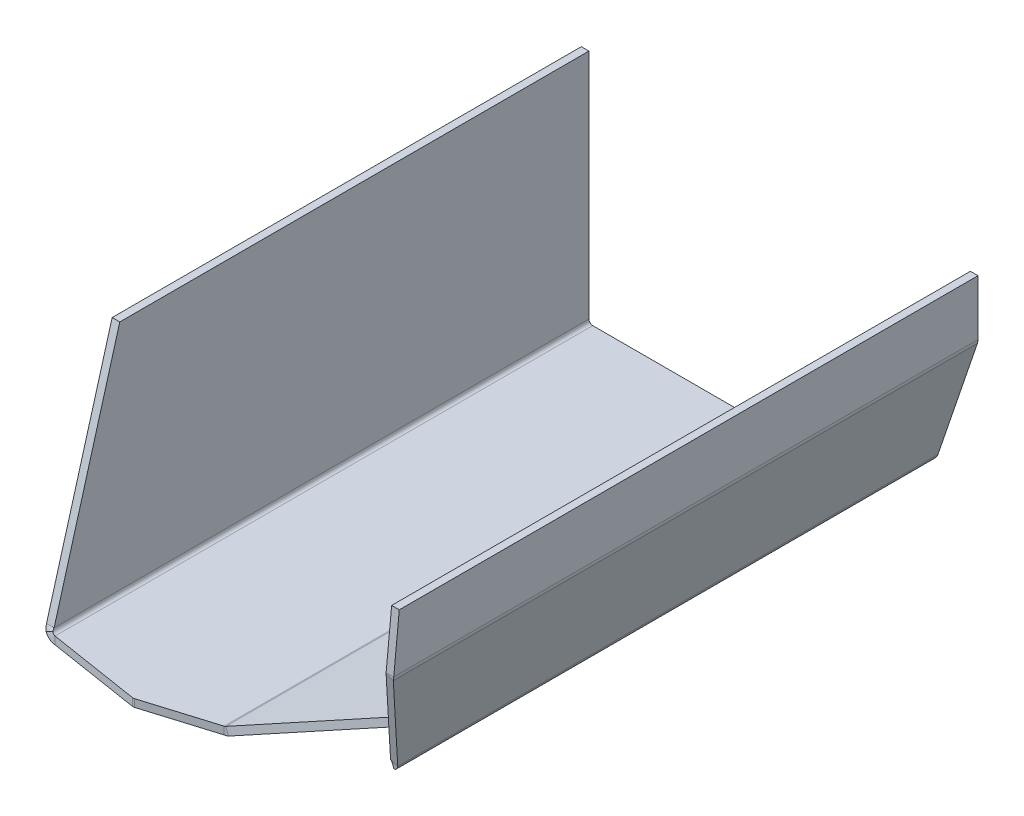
ISO-10303-21;
HEADER;
FILE_DESCRIPTION(('STEP AP214'),'2;1');
FILE_NAME('part.step','',(''),(''),'','','');
FILE_SCHEMA(('AUTOMOTIVE_DESIGN { 1 0 10303 214 1 1 1 1 }'));
ENDSEC;
DATA;
#1=APPLICATION_CONTEXT('core data for automotive mechanical design processes');
#2=APPLICATION_PROTOCOL_DEFINITION('international standard','automotive_design',2000,#1);
#3=PRODUCT_CONTEXT('',#1,'mechanical');
#4=PRODUCT('Part','Part','',(#3));
#5=PRODUCT_RELATED_PRODUCT_CATEGORY('part','',(#4));
#6=PRODUCT_DEFINITION_FORMATION('','',#4);
#7=PRODUCT_DEFINITION_CONTEXT('part definition',#1,'design');
#8=PRODUCT_DEFINITION('design','',#6,#7);
#9=PRODUCT_DEFINITION_SHAPE('','',#8);
#10=(LENGTH_UNIT() NAMED_UNIT(*) SI_UNIT(.MILLI.,.METRE.));
#11=(NAMED_UNIT(*) PLANE_ANGLE_UNIT() SI_UNIT($,.RADIAN.));
#12=(NAMED_UNIT(*) SI_UNIT($,.STERADIAN.) SOLID_ANGLE_UNIT());
#13=UNCERTAINTY_MEASURE_WITH_UNIT(LENGTH_MEASURE(1.E-05),#10,'distance_accuracy_value','');
#14=(GEOMETRIC_REPRESENTATION_CONTEXT(3) GLOBAL_UNCERTAINTY_ASSIGNED_CONTEXT((#13)) GLOBAL_UNIT_ASSIGNED_CONTEXT((#10,
#11,#12)) REPRESENTATION_CONTEXT('',''));
#15=CARTESIAN_POINT('',(0.,0.,0.));
#16=DIRECTION('',(0.,0.,1.));
#17=DIRECTION('',(1.,0.,0.));
#18=AXIS2_PLACEMENT_3D('',#15,#16,#17);
#19=CARTESIAN_POINT('',(102.081649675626,47.203392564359,264.));
#20=DIRECTION('',(-1.,0.,0.));
#21=DIRECTION('',(0.,0.,1.));
#22=AXIS2_PLACEMENT_3D('',#19,#20,#21);
#23=PLANE('',#22);
#24=DIRECTION('',(0.,-0.995076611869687,0.0991087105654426));
#25=VECTOR('',#24,1.);
#26=CARTESIAN_POINT('',(102.081649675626,36.2871828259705,154.398483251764));
#27=LINE('',#26,#25);
#28=CARTESIAN_POINT('',(102.081649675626,61.8874884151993,151.848716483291));
#29=VERTEX_POINT('',#28);
#30=CARTESIAN_POINT('',(102.081649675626,47.3689958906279,153.294744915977));
#31=VERTEX_POINT('',#30);
#32=EDGE_CURVE('E558',#29,#31,#27,.T.);
#33=ORIENTED_EDGE('',*,*,#32,.T.);
#34=DIRECTION('',(0.,0.,-1.));
#35=VECTOR('',#34,1.);
#36=CARTESIAN_POINT('',(102.081649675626,47.3689958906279,264.));
#37=LINE('',#36,#35);
#38=CARTESIAN_POINT('',(102.081649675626,47.3689958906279,0.));
#39=VERTEX_POINT('',#38);
#40=EDGE_CURVE('E58',#31,#39,#37,.T.);
#41=ORIENTED_EDGE('',*,*,#40,.T.);
#42=DIRECTION('',(0.,1.,0.));
#43=VECTOR('',#42,1.);
#44=CARTESIAN_POINT('',(102.081649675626,47.203392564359,0.));
#45=LINE('',#44,#43);
#46=CARTESIAN_POINT('',(102.081649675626,61.8874884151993,0.));
#47=VERTEX_POINT('',#46);
#48=EDGE_CURVE('E400',#39,#47,#45,.T.);
#49=ORIENTED_EDGE('',*,*,#48,.T.);
#50=DIRECTION('',(0.,0.,-1.));
#51=VECTOR('',#50,1.);
#52=CARTESIAN_POINT('',(102.081649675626,61.8874884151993,264.));
#53=LINE('',#52,#51);
#54=EDGE_CURVE('E272',#29,#47,#53,.T.);
#55=ORIENTED_EDGE('',*,*,#54,.F.);
#56=EDGE_LOOP('',(#33,#41,#49,#55));
#57=FACE_BOUND('',#56,.T.);
#58=ADVANCED_FACE('F35',(#57),#23,.F.);
#59=CARTESIAN_POINT('',(100.081649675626,61.8874884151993,264.));
#60=DIRECTION('',(0.,1.,0.));
#61=DIRECTION('',(0.,0.,1.));
#62=AXIS2_PLACEMENT_3D('',#59,#60,#61);
#63=PLANE('',#62);
#64=DIRECTION('',(0.,0.,-1.));
#65=VECTOR('',#64,1.);
#66=CARTESIAN_POINT('',(100.081649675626,61.8874884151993,264.));
#67=LINE('',#66,#65);
#68=CARTESIAN_POINT('',(100.081649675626,61.8874884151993,151.848716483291));
#69=VERTEX_POINT('',#68);
#70=CARTESIAN_POINT('',(100.081649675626,61.8874884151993,0.));
#71=VERTEX_POINT('',#70);
#72=EDGE_CURVE('E270',#69,#71,#67,.T.);
#73=ORIENTED_EDGE('',*,*,#72,.F.);
#74=DIRECTION('',(-1.,0.,0.));
#75=VECTOR('',#74,1.);
#76=CARTESIAN_POINT('',(100.081649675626,61.8874884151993,151.848716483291));
#77=LINE('',#76,#75);
#78=EDGE_CURVE('E560',#69,#29,#77,.F.);
#79=ORIENTED_EDGE('',*,*,#78,.T.);
#80=ORIENTED_EDGE('',*,*,#54,.T.);
#81=DIRECTION('',(1.,0.,0.));
#82=VECTOR('',#81,1.);
#83=CARTESIAN_POINT('',(100.081649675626,61.8874884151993,0.));
#84=LINE('',#83,#82);
#85=EDGE_CURVE('E397',#71,#47,#84,.T.);
#86=ORIENTED_EDGE('',*,*,#85,.F.);
#87=EDGE_LOOP('',(#73,#79,#80,#86));
#88=FACE_BOUND('',#87,.T.);
#89=ADVANCED_FACE('F486',(#88),#63,.T.);
#90=CARTESIAN_POINT('',(100.081649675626,47.203392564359,264.));
#91=DIRECTION('',(-1.,0.,0.));
#92=DIRECTION('',(0.,0.,1.));
#93=AXIS2_PLACEMENT_3D('',#90,#91,#92);
#94=PLANE('',#93);
#95=DIRECTION('',(0.,0.,-1.));
#96=VECTOR('',#95,1.);
#97=CARTESIAN_POINT('',(100.081649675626,47.3689958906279,264.));
#98=LINE('',#97,#96);
#99=CARTESIAN_POINT('',(100.081649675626,47.3689958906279,153.294744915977));
#100=VERTEX_POINT('',#99);
#101=CARTESIAN_POINT('',(100.081649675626,47.3689958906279,0.));
#102=VERTEX_POINT('',#101);
#103=EDGE_CURVE('E268',#100,#102,#98,.T.);
#104=ORIENTED_EDGE('',*,*,#103,.F.);
#105=DIRECTION('',(0.,-0.995076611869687,0.0991087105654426));
#106=VECTOR('',#105,1.);
#107=CARTESIAN_POINT('',(100.081649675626,36.2871828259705,154.398483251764));
#108=LINE('',#107,#106);
#109=EDGE_CURVE('E556',#69,#100,#108,.T.);
#110=ORIENTED_EDGE('',*,*,#109,.F.);
#111=ORIENTED_EDGE('',*,*,#72,.T.);
#112=DIRECTION('',(0.,1.,0.));
#113=VECTOR('',#112,1.);
#114=CARTESIAN_POINT('',(100.081649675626,47.203392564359,0.));
#115=LINE('',#114,#113);
#116=EDGE_CURVE('E394',#102,#71,#115,.T.);
#117=ORIENTED_EDGE('',*,*,#116,.F.);
#118=EDGE_LOOP('',(#104,#110,#111,#117));
#119=FACE_BOUND('',#118,.T.);
#120=ADVANCED_FACE('F482',(#119),#94,.T.);
#121=CARTESIAN_POINT('',(99.0816496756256,47.3689958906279,264.));
#122=DIRECTION('',(0.,0.,-1.));
#123=DIRECTION('',(-1.,0.,0.));
#124=AXIS2_PLACEMENT_3D('',#121,#122,#123);
#125=CYLINDRICAL_SURFACE('',#124,1.);
#126=DIRECTION('',(0.,0.,-1.));
#127=VECTOR('',#126,1.);
#128=CARTESIAN_POINT('',(100.028264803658,47.0466299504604,264.));
#129=LINE('',#128,#127);
#130=CARTESIAN_POINT('',(100.028264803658,47.0466299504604,153.251838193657));
#131=VERTEX_POINT('',#130);
#132=CARTESIAN_POINT('',(100.028264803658,47.0466299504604,0.));
#133=VERTEX_POINT('',#132);
#134=EDGE_CURVE('E266',#131,#133,#129,.T.);
#135=ORIENTED_EDGE('',*,*,#134,.F.);
#136=CARTESIAN_POINT('',(99.0816496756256,47.3689958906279,151.889588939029));
#137=DIRECTION('',(0.813387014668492,-0.0576538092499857,-0.578858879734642));
#138=DIRECTION('',(-0.577410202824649,0.0409275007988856,-0.815427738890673));
#139=AXIS2_PLACEMENT_3D('',#136,#137,#138);
#140=ELLIPSE('',#139,1.72753677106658,1.);
#141=EDGE_CURVE('E551',#100,#131,#140,.T.);
#142=ORIENTED_EDGE('',*,*,#141,.F.);
#143=ORIENTED_EDGE('',*,*,#103,.T.);
#144=CARTESIAN_POINT('',(99.0816496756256,47.3689958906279,0.));
#145=DIRECTION('',(0.,0.,-1.));
#146=DIRECTION('',(-1.,0.,0.));
#147=AXIS2_PLACEMENT_3D('',#144,#145,#146);
#148=CIRCLE('',#147,1.);
#149=EDGE_CURVE('E389',#133,#102,#148,.F.);
#150=ORIENTED_EDGE('',*,*,#149,.F.);
#151=EDGE_LOOP('',(#135,#142,#143,#150));
#152=FACE_BOUND('',#151,.T.);
#153=ADVANCED_FACE('F478',(#152),#125,.F.);
#154=CARTESIAN_POINT('',(89.5254696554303,16.2055777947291,264.));
#155=DIRECTION('',(-0.946615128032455,0.322365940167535,0.));
#156=DIRECTION('',(-0.322365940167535,-0.946615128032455,0.));
#157=AXIS2_PLACEMENT_3D('',#154,#155,#156);
#158=PLANE('',#157);
#159=DIRECTION('',(0.,0.,-1.));
#160=VECTOR('',#159,1.);
#161=CARTESIAN_POINT('',(89.6815545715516,16.6639151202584,264.));
#162=LINE('',#161,#160);
#163=CARTESIAN_POINT('',(89.6815545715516,16.6639151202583,141.739186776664));
#164=VERTEX_POINT('',#163);
#165=CARTESIAN_POINT('',(89.6815545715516,16.6639151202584,0.));
#166=VERTEX_POINT('',#165);
#167=EDGE_CURVE('E264',#164,#166,#162,.T.);
#168=ORIENTED_EDGE('',*,*,#167,.F.);
#169=DIRECTION('',(-0.30343629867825,-0.891028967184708,-0.337629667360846));
#170=VECTOR('',#169,1.);
#171=CARTESIAN_POINT('',(102.068772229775,53.0385011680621,155.522284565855));
#172=LINE('',#171,#170);
#173=EDGE_CURVE('E566',#131,#164,#172,.T.);
#174=ORIENTED_EDGE('',*,*,#173,.F.);
#175=ORIENTED_EDGE('',*,*,#134,.T.);
#176=DIRECTION('',(0.322365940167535,0.946615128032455,0.));
#177=VECTOR('',#176,1.);
#178=CARTESIAN_POINT('',(89.5254696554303,16.2055777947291,0.));
#179=LINE('',#178,#177);
#180=EDGE_CURVE('E385',#166,#133,#179,.T.);
#181=ORIENTED_EDGE('',*,*,#180,.F.);
#182=EDGE_LOOP('',(#168,#174,#175,#181));
#183=FACE_BOUND('',#182,.T.);
#184=ADVANCED_FACE('F475',(#183),#158,.T.);
#185=CARTESIAN_POINT('',(88.7349394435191,16.9862810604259,264.));
#186=DIRECTION('',(0.,0.,-1.));
#187=DIRECTION('',(-1.,0.,0.));
#188=AXIS2_PLACEMENT_3D('',#185,#186,#187);
#189=CYLINDRICAL_SURFACE('',#188,1.);
#190=DIRECTION('',(0.,0.,-1.));
#191=VECTOR('',#190,1.);
#192=CARTESIAN_POINT('',(89.0691205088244,16.0437721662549,264.));
#193=LINE('',#192,#191);
#194=CARTESIAN_POINT('',(89.0691205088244,16.0437721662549,140.940387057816));
#195=VERTEX_POINT('',#194);
#196=CARTESIAN_POINT('',(89.0691205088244,16.0437721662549,0.));
#197=VERTEX_POINT('',#196);
#198=EDGE_CURVE('E262',#195,#197,#193,.T.);
#199=ORIENTED_EDGE('',*,*,#198,.F.);
#200=CARTESIAN_POINT('',(88.7349394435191,16.9862810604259,140.376937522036));
#201=DIRECTION('',(0.813387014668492,-0.0576538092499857,-0.578858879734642));
#202=DIRECTION('',(-0.577410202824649,0.0409275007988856,-0.815427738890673));
#203=AXIS2_PLACEMENT_3D('',#200,#201,#202);
#204=ELLIPSE('',#203,1.72753677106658,1.);
#205=EDGE_CURVE('E546',#164,#195,#204,.T.);
#206=ORIENTED_EDGE('',*,*,#205,.F.);
#207=ORIENTED_EDGE('',*,*,#167,.T.);
#208=CARTESIAN_POINT('',(88.7349394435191,16.9862810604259,0.));
#209=DIRECTION('',(0.,0.,-1.));
#210=DIRECTION('',(-1.,0.,0.));
#211=AXIS2_PLACEMENT_3D('',#208,#209,#210);
#212=CIRCLE('',#211,1.);
#213=EDGE_CURVE('E379',#197,#166,#212,.F.);
#214=ORIENTED_EDGE('',*,*,#213,.F.);
#215=EDGE_LOOP('',(#199,#206,#207,#214));
#216=FACE_BOUND('',#215,.T.);
#217=ADVANCED_FACE('F382',(#216),#189,.F.);
#218=CARTESIAN_POINT('',(43.820003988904,0.,264.));
#219=DIRECTION('',(-0.334181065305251,0.942508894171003,0.));
#220=DIRECTION('',(-0.942508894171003,-0.334181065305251,0.));
#221=AXIS2_PLACEMENT_3D('',#218,#219,#220);
#222=PLANE('',#221);
#223=CARTESIAN_POINT('',(76.3194549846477,11.5231816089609,128.657975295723));
#224=DIRECTION('',(-0.334181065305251,0.942508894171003,0.));
#225=DIRECTION('',(-0.507415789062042,-0.179912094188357,0.842710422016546));
#226=AXIS2_PLACEMENT_3D('',#223,#224,#225);
#227=ELLIPSE('',#226,3.19503602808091,2.99999999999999);
#228=CARTESIAN_POINT('',(78.6145448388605,12.336941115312,126.619274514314));
#229=VERTEX_POINT('',#228);
#230=CARTESIAN_POINT('',(75.3963302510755,11.1958734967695,125.745914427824));
#231=VERTEX_POINT('',#230);
#232=EDGE_CURVE('E577',#229,#231,#227,.T.);
#233=ORIENTED_EDGE('',*,*,#232,.F.);
#234=DIRECTION('',(-0.577140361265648,-0.204634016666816,-0.790590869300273));
#235=VECTOR('',#234,1.);
#236=CARTESIAN_POINT('',(128.25211077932,29.9367057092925,194.614876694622));
#237=LINE('',#236,#235);
#238=EDGE_CURVE('E581',#195,#229,#237,.T.);
#239=ORIENTED_EDGE('',*,*,#238,.F.);
#240=ORIENTED_EDGE('',*,*,#198,.T.);
#241=DIRECTION('',(0.942508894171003,0.334181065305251,0.));
#242=VECTOR('',#241,1.);
#243=CARTESIAN_POINT('',(43.820003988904,0.,0.));
#244=LINE('',#243,#242);
#245=CARTESIAN_POINT('',(43.982149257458,0.0574911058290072,0.));
#246=VERTEX_POINT('',#245);
#247=EDGE_CURVE('E373',#246,#197,#244,.T.);
#248=ORIENTED_EDGE('',*,*,#247,.F.);
#249=DIRECTION('',(0.,0.,-1.));
#250=VECTOR('',#249,1.);
#251=CARTESIAN_POINT('',(43.982149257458,0.0574911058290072,264.));
#252=LINE('',#251,#250);
#253=CARTESIAN_POINT('',(43.982149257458,0.0574911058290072,139.252749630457));
#254=VERTEX_POINT('',#253);
#255=EDGE_CURVE('E260',#254,#246,#252,.T.);
#256=ORIENTED_EDGE('',*,*,#255,.F.);
#257=DIRECTION('',(-0.873510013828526,-0.309716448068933,0.375574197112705));
#258=VECTOR('',#257,1.);
#259=CARTESIAN_POINT('',(2.91731680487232,-14.5026786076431,156.908977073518));
#260=LINE('',#259,#258);
#261=EDGE_CURVE('E587',#231,#254,#260,.T.);
#262=ORIENTED_EDGE('',*,*,#261,.F.);
#263=EDGE_LOOP('',(#233,#239,#240,#248,#256,#262));
#264=FACE_BOUND('',#263,.T.);
#265=ADVANCED_FACE('F468',(#264),#222,.T.);
#266=CARTESIAN_POINT('',(43.6479681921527,1.00000000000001,264.));
#267=DIRECTION('',(0.,0.,-1.));
#268=DIRECTION('',(-1.,0.,0.));
#269=AXIS2_PLACEMENT_3D('',#266,#267,#268);
#270=CYLINDRICAL_SURFACE('',#269,1.);
#271=DIRECTION('',(0.,0.,-1.));
#272=VECTOR('',#271,1.);
#273=CARTESIAN_POINT('',(43.6479681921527,0.,264.));
#274=LINE('',#273,#272);
#275=CARTESIAN_POINT('',(43.6479681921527,0.,139.375017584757));
#276=VERTEX_POINT('',#275);
#277=CARTESIAN_POINT('',(43.6479681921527,0.,0.));
#278=VERTEX_POINT('',#277);
#279=EDGE_CURVE('E258',#276,#278,#274,.T.);
#280=ORIENTED_EDGE('',*,*,#279,.F.);
#281=CARTESIAN_POINT('',(43.6479681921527,1.00000000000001,139.023916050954));
#282=DIRECTION('',(-0.276948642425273,-0.318318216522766,-0.906627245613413));
#283=DIRECTION('',(0.595093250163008,0.683986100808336,-0.421932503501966));
#284=AXIS2_PLACEMENT_3D('',#281,#282,#283);
#285=ELLIPSE('',#284,1.10298913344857,1.);
#286=EDGE_CURVE('E542',#254,#276,#285,.T.);
#287=ORIENTED_EDGE('',*,*,#286,.F.);
#288=ORIENTED_EDGE('',*,*,#255,.T.);
#289=CARTESIAN_POINT('',(43.6479681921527,1.00000000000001,0.));
#290=DIRECTION('',(0.,0.,-1.));
#291=DIRECTION('',(-1.,0.,0.));
#292=AXIS2_PLACEMENT_3D('',#289,#290,#291);
#293=CIRCLE('',#292,1.);
#294=EDGE_CURVE('E307',#278,#246,#293,.F.);
#295=ORIENTED_EDGE('',*,*,#294,.F.);
#296=EDGE_LOOP('',(#280,#287,#288,#295));
#297=FACE_BOUND('',#296,.T.);
#298=ADVANCED_FACE('F465',(#297),#270,.F.);
#299=CARTESIAN_POINT('',(0.,0.,264.));
#300=DIRECTION('',(0.,1.,0.));
#301=DIRECTION('',(0.,0.,1.));
#302=AXIS2_PLACEMENT_3D('',#299,#300,#301);
#303=PLANE('',#302);
#304=DIRECTION('',(0.,0.,-1.));
#305=VECTOR('',#304,1.);
#306=CARTESIAN_POINT('',(1.,0.,264.));
#307=LINE('',#306,#305);
#308=CARTESIAN_POINT('',(1.,0.,141.083825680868));
#309=VERTEX_POINT('',#308);
#310=CARTESIAN_POINT('',(1.,0.,0.));
#311=VERTEX_POINT('',#310);
#312=EDGE_CURVE('E256',#309,#311,#307,.T.);
#313=ORIENTED_EDGE('',*,*,#312,.F.);
#314=DIRECTION('',(-0.987665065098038,0.,-0.156581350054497));
#315=VECTOR('',#314,1.);
#316=CARTESIAN_POINT('',(19.0334953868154,0.,143.94279999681));
#317=LINE('',#316,#315);
#318=CARTESIAN_POINT('',(25.1710812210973,0.,144.915833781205));
#319=VERTEX_POINT('',#318);
#320=EDGE_CURVE('E224',#319,#309,#317,.T.);
#321=ORIENTED_EDGE('',*,*,#320,.F.);
#322=CARTESIAN_POINT('',(25.282325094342,0.,143.88220611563));
#323=DIRECTION('',(0.,1.,0.));
#324=DIRECTION('',(0.432856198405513,0.,0.901462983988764));
#325=AXIS2_PLACEMENT_3D('',#322,#323,#324);
#326=ELLIPSE('',#325,1.05610997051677,0.999999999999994);
#327=CARTESIAN_POINT('',(25.6060740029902,0.,144.886299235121));
#328=VERTEX_POINT('',#327);
#329=EDGE_CURVE('E637',#328,#319,#326,.F.);
#330=ORIENTED_EDGE('',*,*,#329,.F.);
#331=DIRECTION('',(-0.956374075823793,0.,0.292144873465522));
#332=VECTOR('',#331,1.);
#333=CARTESIAN_POINT('',(-31.0948989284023,0.,162.206821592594));
#334=LINE('',#333,#332);
#335=EDGE_CURVE('E624',#276,#328,#334,.T.);
#336=ORIENTED_EDGE('',*,*,#335,.F.);
#337=ORIENTED_EDGE('',*,*,#279,.T.);
#338=DIRECTION('',(1.,0.,0.));
#339=VECTOR('',#338,1.);
#340=CARTESIAN_POINT('',(0.,0.,0.));
#341=LINE('',#340,#339);
#342=EDGE_CURVE('E296',#311,#278,#341,.T.);
#343=ORIENTED_EDGE('',*,*,#342,.F.);
#344=EDGE_LOOP('',(#313,#321,#330,#336,#337,#343));
#345=FACE_BOUND('',#344,.T.);
#346=ADVANCED_FACE('F302',(#345),#303,.T.);
#347=CARTESIAN_POINT('',(1.,1.,264.));
#348=DIRECTION('',(0.,0.,-1.));
#349=DIRECTION('',(-1.,0.,0.));
#350=AXIS2_PLACEMENT_3D('',#347,#348,#349);
#351=CYLINDRICAL_SURFACE('',#350,1.);
#352=DIRECTION('',(0.,0.,-1.));
#353=VECTOR('',#352,1.);
#354=CARTESIAN_POINT('',(0.,1.,264.));
#355=LINE('',#354,#353);
#356=CARTESIAN_POINT('',(0.,1.,140.325333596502));
#357=VERTEX_POINT('',#356);
#358=CARTESIAN_POINT('',(0.,1.,0.));
#359=VERTEX_POINT('',#358);
#360=EDGE_CURVE('E254',#357,#359,#355,.T.);
#361=ORIENTED_EDGE('',*,*,#360,.F.);
#362=CARTESIAN_POINT('',(1.,1.,140.800944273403));
#363=DIRECTION('',(0.34090648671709,-0.608288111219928,-0.716776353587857));
#364=DIRECTION('',(-0.3504268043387,0.625275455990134,-0.697303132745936));
#365=AXIS2_PLACEMENT_3D('',#362,#363,#364);
#366=ELLIPSE('',#365,1.39513530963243,1.);
#367=CARTESIAN_POINT('',(0.127656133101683,0.511107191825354,140.800944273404));
#368=VERTEX_POINT('',#367);
#369=EDGE_CURVE('E520',#368,#357,#366,.T.);
#370=ORIENTED_EDGE('',*,*,#369,.F.);
#371=CARTESIAN_POINT('',(1.,1.,140.800944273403));
#372=DIRECTION('',(0.150805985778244,-0.269086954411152,-0.951235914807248));
#373=DIRECTION('',(-0.465052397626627,0.829804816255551,-0.308464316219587));
#374=AXIS2_PLACEMENT_3D('',#371,#372,#373);
#375=ELLIPSE('',#374,1.05126392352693,1.);
#376=EDGE_CURVE('E215',#309,#368,#375,.T.);
#377=ORIENTED_EDGE('',*,*,#376,.F.);
#378=ORIENTED_EDGE('',*,*,#312,.T.);
#379=CARTESIAN_POINT('',(1.,1.,0.));
#380=DIRECTION('',(0.,0.,-1.));
#381=DIRECTION('',(-1.,0.,0.));
#382=AXIS2_PLACEMENT_3D('',#379,#380,#381);
#383=CIRCLE('',#382,1.);
#384=EDGE_CURVE('E306',#359,#311,#383,.F.);
#385=ORIENTED_EDGE('',*,*,#384,.F.);
#386=EDGE_LOOP('',(#361,#370,#377,#378,#385));
#387=FACE_BOUND('',#386,.T.);
#388=ADVANCED_FACE('F459',(#387),#351,.F.);
#389=CARTESIAN_POINT('',(0.,61.8874884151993,264.));
#390=DIRECTION('',(1.,0.,0.));
#391=DIRECTION('',(0.,0.,-1.));
#392=AXIS2_PLACEMENT_3D('',#389,#390,#391);
#393=PLANE('',#392);
#394=DIRECTION('',(0.,0.,-1.));
#395=VECTOR('',#394,1.);
#396=CARTESIAN_POINT('',(0.,61.8874884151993,264.));
#397=LINE('',#396,#395);
#398=CARTESIAN_POINT('',(0.,61.8874884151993,123.101395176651));
#399=VERTEX_POINT('',#398);
#400=CARTESIAN_POINT('',(0.,61.8874884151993,0.));
#401=VERTEX_POINT('',#400);
#402=EDGE_CURVE('E252',#399,#401,#397,.T.);
#403=ORIENTED_EDGE('',*,*,#402,.F.);
#404=DIRECTION('',(0.,0.962240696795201,-0.272200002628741));
#405=VECTOR('',#404,1.);
#406=CARTESIAN_POINT('',(0.,24.9830552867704,133.540973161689));
#407=LINE('',#406,#405);
#408=EDGE_CURVE('E518',#357,#399,#407,.T.);
#409=ORIENTED_EDGE('',*,*,#408,.F.);
#410=ORIENTED_EDGE('',*,*,#360,.T.);
#411=DIRECTION('',(0.,-1.,0.));
#412=VECTOR('',#411,1.);
#413=CARTESIAN_POINT('',(0.,61.8874884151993,0.));
#414=LINE('',#413,#412);
#415=EDGE_CURVE('E314',#401,#359,#414,.T.);
#416=ORIENTED_EDGE('',*,*,#415,.F.);
#417=EDGE_LOOP('',(#403,#409,#410,#416));
#418=FACE_BOUND('',#417,.T.);
#419=ADVANCED_FACE('F455',(#418),#393,.T.);
#420=CARTESIAN_POINT('',(-2.,61.8874884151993,264.));
#421=DIRECTION('',(0.,1.,0.));
#422=DIRECTION('',(0.,0.,1.));
#423=AXIS2_PLACEMENT_3D('',#420,#421,#422);
#424=PLANE('',#423);
#425=DIRECTION('',(0.,0.,-1.));
#426=VECTOR('',#425,1.);
#427=CARTESIAN_POINT('',(-2.,61.8874884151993,264.));
#428=LINE('',#427,#426);
#429=CARTESIAN_POINT('',(-2.,61.8874884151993,123.101395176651));
#430=VERTEX_POINT('',#429);
#431=CARTESIAN_POINT('',(-2.,61.8874884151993,0.));
#432=VERTEX_POINT('',#431);
#433=EDGE_CURVE('E245',#430,#432,#428,.T.);
#434=ORIENTED_EDGE('',*,*,#433,.F.);
#435=DIRECTION('',(-1.,0.,0.));
#436=VECTOR('',#435,1.);
#437=CARTESIAN_POINT('',(-2.,61.8874884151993,123.101395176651));
#438=LINE('',#437,#436);
#439=EDGE_CURVE('E539',#430,#399,#438,.F.);
#440=ORIENTED_EDGE('',*,*,#439,.T.);
#441=ORIENTED_EDGE('',*,*,#402,.T.);
#442=DIRECTION('',(1.,0.,0.));
#443=VECTOR('',#442,1.);
#444=CARTESIAN_POINT('',(-2.,61.8874884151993,0.));
#445=LINE('',#444,#443);
#446=EDGE_CURVE('E316',#432,#401,#445,.T.);
#447=ORIENTED_EDGE('',*,*,#446,.F.);
#448=EDGE_LOOP('',(#434,#440,#441,#447));
#449=FACE_BOUND('',#448,.T.);
#450=ADVANCED_FACE('F451',(#449),#424,.T.);
#451=CARTESIAN_POINT('',(-2.,61.8874884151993,264.));
#452=DIRECTION('',(1.,0.,0.));
#453=DIRECTION('',(0.,0.,-1.));
#454=AXIS2_PLACEMENT_3D('',#451,#452,#453);
#455=PLANE('',#454);
#456=DIRECTION('',(0.,0.962240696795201,-0.272200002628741));
#457=VECTOR('',#456,1.);
#458=CARTESIAN_POINT('',(-2.,24.9830552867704,133.540973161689));
#459=LINE('',#458,#457);
#460=CARTESIAN_POINT('',(-2.,1.,140.325333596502));
#461=VERTEX_POINT('',#460);
#462=EDGE_CURVE('E523',#461,#430,#459,.T.);
#463=ORIENTED_EDGE('',*,*,#462,.T.);
#464=ORIENTED_EDGE('',*,*,#433,.T.);
#465=DIRECTION('',(0.,1.,0.));
#466=VECTOR('',#465,1.);
#467=CARTESIAN_POINT('',(-2.,61.8874884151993,0.));
#468=LINE('',#467,#466);
#469=CARTESIAN_POINT('',(-2.,1.,0.));
#470=VERTEX_POINT('',#469);
#471=EDGE_CURVE('E322',#432,#470,#468,.F.);
#472=ORIENTED_EDGE('',*,*,#471,.T.);
#473=DIRECTION('',(0.,0.,-1.));
#474=VECTOR('',#473,1.);
#475=CARTESIAN_POINT('',(-2.,1.,264.));
#476=LINE('',#475,#474);
#477=EDGE_CURVE('E242',#461,#470,#476,.T.);
#478=ORIENTED_EDGE('',*,*,#477,.F.);
#479=EDGE_LOOP('',(#463,#464,#472,#478));
#480=FACE_BOUND('',#479,.T.);
#481=ADVANCED_FACE('F448',(#480),#455,.F.);
#482=CARTESIAN_POINT('',(1.,1.,264.));
#483=DIRECTION('',(0.,0.,-1.));
#484=DIRECTION('',(-1.,0.,0.));
#485=AXIS2_PLACEMENT_3D('',#482,#483,#484);
#486=CYLINDRICAL_SURFACE('',#485,3.);
#487=CARTESIAN_POINT('',(1.,1.,140.800944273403));
#488=DIRECTION('',(0.150805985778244,-0.269086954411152,-0.951235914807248));
#489=DIRECTION('',(-0.465052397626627,0.829804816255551,-0.308464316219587));
#490=AXIS2_PLACEMENT_3D('',#487,#488,#489);
#491=ELLIPSE('',#490,3.1537917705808,3.);
#492=CARTESIAN_POINT('',(-1.61703160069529,-0.466678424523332,140.800944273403));
#493=VERTEX_POINT('',#492);
#494=EDGE_CURVE('E524',#493,#461,#491,.T.);
#495=ORIENTED_EDGE('',*,*,#494,.T.);
#496=ORIENTED_EDGE('',*,*,#477,.T.);
#497=CARTESIAN_POINT('',(1.,1.,0.));
#498=DIRECTION('',(0.,0.,1.));
#499=DIRECTION('',(1.,0.,0.));
#500=AXIS2_PLACEMENT_3D('',#497,#498,#499);
#501=CIRCLE('',#500,3.);
#502=CARTESIAN_POINT('',(1.,-2.,0.));
#503=VERTEX_POINT('',#502);
#504=EDGE_CURVE('E240',#470,#503,#501,.T.);
#505=ORIENTED_EDGE('',*,*,#504,.T.);
#506=DIRECTION('',(0.,0.,-1.));
#507=VECTOR('',#506,1.);
#508=CARTESIAN_POINT('',(1.,-2.,264.));
#509=LINE('',#508,#507);
#510=CARTESIAN_POINT('',(1.,-2.,141.083825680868));
#511=VERTEX_POINT('',#510);
#512=EDGE_CURVE('E232',#511,#503,#509,.T.);
#513=ORIENTED_EDGE('',*,*,#512,.F.);
#514=CARTESIAN_POINT('',(1.,1.,140.800944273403));
#515=DIRECTION('',(0.0525395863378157,-0.0937477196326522,-0.994208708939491));
#516=DIRECTION('',(-0.486061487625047,0.867291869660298,-0.107466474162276));
#517=AXIS2_PLACEMENT_3D('',#514,#515,#516);
#518=ELLIPSE('',#517,3.01747507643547,3.);
#519=EDGE_CURVE('E204',#511,#493,#518,.T.);
#520=ORIENTED_EDGE('',*,*,#519,.T.);
#521=EDGE_LOOP('',(#495,#496,#505,#513,#520));
#522=FACE_BOUND('',#521,.T.);
#523=ADVANCED_FACE('F238',(#522),#486,.T.);
#524=CARTESIAN_POINT('',(0.,-2.,264.));
#525=DIRECTION('',(0.,1.,0.));
#526=DIRECTION('',(0.,0.,1.));
#527=AXIS2_PLACEMENT_3D('',#524,#525,#526);
#528=PLANE('',#527);
#529=DIRECTION('',(-0.987665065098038,0.,-0.156581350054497));
#530=VECTOR('',#529,1.);
#531=CARTESIAN_POINT('',(19.0334953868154,-2.,143.94279999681));
#532=LINE('',#531,#530);
#533=CARTESIAN_POINT('',(25.1710812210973,-2.,144.915833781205));
#534=VERTEX_POINT('',#533);
#535=EDGE_CURVE('E221',#534,#511,#532,.T.);
#536=ORIENTED_EDGE('',*,*,#535,.T.);
#537=ORIENTED_EDGE('',*,*,#512,.T.);
#538=DIRECTION('',(1.,0.,0.));
#539=VECTOR('',#538,1.);
#540=CARTESIAN_POINT('',(0.,-2.,0.));
#541=LINE('',#540,#539);
#542=CARTESIAN_POINT('',(43.6479681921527,-1.99999999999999,0.));
#543=VERTEX_POINT('',#542);
#544=EDGE_CURVE('E297',#503,#543,#541,.T.);
#545=ORIENTED_EDGE('',*,*,#544,.T.);
#546=DIRECTION('',(0.,0.,-1.));
#547=VECTOR('',#546,1.);
#548=CARTESIAN_POINT('',(43.6479681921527,-1.99999999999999,264.));
#549=LINE('',#548,#547);
#550=CARTESIAN_POINT('',(43.6479681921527,-2.,139.375017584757));
#551=VERTEX_POINT('',#550);
#552=EDGE_CURVE('E243',#551,#543,#549,.T.);
#553=ORIENTED_EDGE('',*,*,#552,.F.);
#554=DIRECTION('',(-0.956374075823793,0.,0.292144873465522));
#555=VECTOR('',#554,1.);
#556=CARTESIAN_POINT('',(-31.0948989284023,-2.,162.206821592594));
#557=LINE('',#556,#555);
#558=CARTESIAN_POINT('',(25.6060740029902,-2.,144.886299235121));
#559=VERTEX_POINT('',#558);
#560=EDGE_CURVE('E635',#551,#559,#557,.T.);
#561=ORIENTED_EDGE('',*,*,#560,.T.);
#562=CARTESIAN_POINT('',(25.282325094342,-2.,143.88220611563));
#563=DIRECTION('',(0.,1.,0.));
#564=DIRECTION('',(0.432856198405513,0.,0.901462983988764));
#565=AXIS2_PLACEMENT_3D('',#562,#563,#564);
#566=ELLIPSE('',#565,1.05610997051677,0.999999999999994);
#567=EDGE_CURVE('E235',#559,#534,#566,.F.);
#568=ORIENTED_EDGE('',*,*,#567,.T.);
#569=EDGE_LOOP('',(#536,#537,#545,#553,#561,#568));
#570=FACE_BOUND('',#569,.T.);
#571=ADVANCED_FACE('F230',(#570),#528,.F.);
#572=CARTESIAN_POINT('',(43.6479681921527,1.00000000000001,264.));
#573=DIRECTION('',(0.,0.,-1.));
#574=DIRECTION('',(-1.,0.,0.));
#575=AXIS2_PLACEMENT_3D('',#572,#573,#574);
#576=CYLINDRICAL_SURFACE('',#575,3.);
#577=CARTESIAN_POINT('',(43.6479681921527,1.00000000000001,139.023916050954));
#578=DIRECTION('',(-0.100620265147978,-0.115650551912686,-0.988180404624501));
#579=DIRECTION('',(0.648623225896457,0.745512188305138,-0.153295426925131));
#580=AXIS2_PLACEMENT_3D('',#577,#578,#579);
#581=ELLIPSE('',#580,3.03588290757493,3.);
#582=CARTESIAN_POINT('',(44.6505113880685,-1.827526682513,139.252749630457));
#583=VERTEX_POINT('',#582);
#584=EDGE_CURVE('E544',#583,#551,#581,.T.);
#585=ORIENTED_EDGE('',*,*,#584,.T.);
#586=ORIENTED_EDGE('',*,*,#552,.T.);
#587=CARTESIAN_POINT('',(43.6479681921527,1.00000000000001,0.));
#588=DIRECTION('',(0.,0.,1.));
#589=DIRECTION('',(1.,0.,0.));
#590=AXIS2_PLACEMENT_3D('',#587,#588,#589);
#591=CIRCLE('',#590,3.);
#592=CARTESIAN_POINT('',(44.6505113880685,-1.827526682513,0.));
#593=VERTEX_POINT('',#592);
#594=EDGE_CURVE('E327',#543,#593,#591,.T.);
#595=ORIENTED_EDGE('',*,*,#594,.T.);
#596=DIRECTION('',(0.,0.,-1.));
#597=VECTOR('',#596,1.);
#598=CARTESIAN_POINT('',(44.6505113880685,-1.827526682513,264.));
#599=LINE('',#598,#597);
#600=EDGE_CURVE('E247',#583,#593,#599,.T.);
#601=ORIENTED_EDGE('',*,*,#600,.F.);
#602=EDGE_LOOP('',(#585,#586,#595,#601));
#603=FACE_BOUND('',#602,.T.);
#604=ADVANCED_FACE('F369',(#603),#576,.T.);
#605=CARTESIAN_POINT('',(44.4883661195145,-1.88501778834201,264.));
#606=DIRECTION('',(-0.334181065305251,0.942508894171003,0.));
#607=DIRECTION('',(-0.942508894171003,-0.334181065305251,0.));
#608=AXIS2_PLACEMENT_3D('',#605,#606,#607);
#609=PLANE('',#608);
#610=DIRECTION('',(-0.577140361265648,-0.204634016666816,-0.790590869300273));
#611=VECTOR('',#610,1.);
#612=CARTESIAN_POINT('',(128.920472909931,28.0516879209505,194.614876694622));
#613=LINE('',#612,#611);
#614=CARTESIAN_POINT('',(89.7374826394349,14.1587543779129,140.940387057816));
#615=VERTEX_POINT('',#614);
#616=CARTESIAN_POINT('',(79.282906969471,10.45192332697,126.619274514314));
#617=VERTEX_POINT('',#616);
#618=EDGE_CURVE('E582',#615,#617,#613,.T.);
#619=ORIENTED_EDGE('',*,*,#618,.T.);
#620=CARTESIAN_POINT('',(76.9878171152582,9.63816382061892,128.657975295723));
#621=DIRECTION('',(-0.334181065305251,0.942508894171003,0.));
#622=DIRECTION('',(-0.507415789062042,-0.179912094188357,0.842710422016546));
#623=AXIS2_PLACEMENT_3D('',#620,#621,#622);
#624=ELLIPSE('',#623,3.19503602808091,2.99999999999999);
#625=CARTESIAN_POINT('',(76.0646923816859,9.31085570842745,125.745914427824));
#626=VERTEX_POINT('',#625);
#627=EDGE_CURVE('E579',#617,#626,#624,.T.);
#628=ORIENTED_EDGE('',*,*,#627,.T.);
#629=DIRECTION('',(-0.873510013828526,-0.309716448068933,0.375574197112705));
#630=VECTOR('',#629,1.);
#631=CARTESIAN_POINT('',(3.58567893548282,-16.3876963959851,156.908977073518));
#632=LINE('',#631,#630);
#633=EDGE_CURVE('E358',#626,#583,#632,.T.);
#634=ORIENTED_EDGE('',*,*,#633,.T.);
#635=ORIENTED_EDGE('',*,*,#600,.T.);
#636=DIRECTION('',(0.942508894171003,0.334181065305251,0.));
#637=VECTOR('',#636,1.);
#638=CARTESIAN_POINT('',(44.4883661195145,-1.88501778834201,0.));
#639=LINE('',#638,#637);
#640=CARTESIAN_POINT('',(89.7374826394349,14.1587543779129,0.));
#641=VERTEX_POINT('',#640);
#642=EDGE_CURVE('E330',#593,#641,#639,.T.);
#643=ORIENTED_EDGE('',*,*,#642,.T.);
#644=DIRECTION('',(0.,0.,-1.));
#645=VECTOR('',#644,1.);
#646=CARTESIAN_POINT('',(89.7374826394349,14.1587543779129,264.));
#647=LINE('',#646,#645);
#648=EDGE_CURVE('E347',#615,#641,#647,.T.);
#649=ORIENTED_EDGE('',*,*,#648,.F.);
#650=EDGE_LOOP('',(#619,#628,#634,#635,#643,#649));
#651=FACE_BOUND('',#650,.T.);
#652=ADVANCED_FACE('F353',(#651),#609,.F.);
#653=CARTESIAN_POINT('',(88.7349394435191,16.9862810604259,264.));
#654=DIRECTION('',(0.,0.,-1.));
#655=DIRECTION('',(-1.,0.,0.));
#656=AXIS2_PLACEMENT_3D('',#653,#654,#655);
#657=CYLINDRICAL_SURFACE('',#656,3.);
#658=CARTESIAN_POINT('',(88.7349394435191,16.9862810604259,140.376937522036));
#659=DIRECTION('',(0.423971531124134,-0.030051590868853,-0.905176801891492));
#660=DIRECTION('',(-0.902911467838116,0.0639994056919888,-0.42503524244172));
#661=AXIS2_PLACEMENT_3D('',#658,#659,#660);
#662=ELLIPSE('',#661,3.31426964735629,3.);
#663=CARTESIAN_POINT('',(91.5747848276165,16.0191832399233,141.739186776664));
#664=VERTEX_POINT('',#663);
#665=EDGE_CURVE('E548',#664,#615,#662,.T.);
#666=ORIENTED_EDGE('',*,*,#665,.T.);
#667=ORIENTED_EDGE('',*,*,#648,.T.);
#668=CARTESIAN_POINT('',(88.7349394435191,16.9862810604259,0.));
#669=DIRECTION('',(0.,0.,1.));
#670=DIRECTION('',(1.,0.,0.));
#671=AXIS2_PLACEMENT_3D('',#668,#669,#670);
#672=CIRCLE('',#671,3.);
#673=CARTESIAN_POINT('',(91.5747848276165,16.0191832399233,0.));
#674=VERTEX_POINT('',#673);
#675=EDGE_CURVE('E333',#641,#674,#672,.T.);
#676=ORIENTED_EDGE('',*,*,#675,.T.);
#677=DIRECTION('',(0.,0.,-1.));
#678=VECTOR('',#677,1.);
#679=CARTESIAN_POINT('',(91.5747848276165,16.0191832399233,264.));
#680=LINE('',#679,#678);
#681=EDGE_CURVE('E345',#664,#674,#680,.T.);
#682=ORIENTED_EDGE('',*,*,#681,.F.);
#683=EDGE_LOOP('',(#666,#667,#676,#682));
#684=FACE_BOUND('',#683,.T.);
#685=ADVANCED_FACE('F435',(#684),#657,.T.);
#686=CARTESIAN_POINT('',(91.4186999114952,15.5608459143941,264.));
#687=DIRECTION('',(-0.946615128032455,0.322365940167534,0.));
#688=DIRECTION('',(-0.322365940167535,-0.946615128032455,0.));
#689=AXIS2_PLACEMENT_3D('',#686,#687,#688);
#690=PLANE('',#689);
#691=DIRECTION('',(-0.30343629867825,-0.891028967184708,-0.337629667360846));
#692=VECTOR('',#691,1.);
#693=CARTESIAN_POINT('',(103.96200248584,52.393769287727,155.522284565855));
#694=LINE('',#693,#692);
#695=CARTESIAN_POINT('',(101.921495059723,46.4018980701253,153.251838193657));
#696=VERTEX_POINT('',#695);
#697=EDGE_CURVE('E569',#696,#664,#694,.T.);
#698=ORIENTED_EDGE('',*,*,#697,.T.);
#699=ORIENTED_EDGE('',*,*,#681,.T.);
#700=DIRECTION('',(0.322365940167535,0.946615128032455,0.));
#701=VECTOR('',#700,1.);
#702=CARTESIAN_POINT('',(91.4186999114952,15.5608459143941,0.));
#703=LINE('',#702,#701);
#704=CARTESIAN_POINT('',(101.921495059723,46.4018980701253,0.));
#705=VERTEX_POINT('',#704);
#706=EDGE_CURVE('E336',#674,#705,#703,.T.);
#707=ORIENTED_EDGE('',*,*,#706,.T.);
#708=DIRECTION('',(0.,0.,-1.));
#709=VECTOR('',#708,1.);
#710=CARTESIAN_POINT('',(101.921495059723,46.4018980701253,264.));
#711=LINE('',#710,#709);
#712=EDGE_CURVE('E343',#696,#705,#711,.T.);
#713=ORIENTED_EDGE('',*,*,#712,.F.);
#714=EDGE_LOOP('',(#698,#699,#707,#713));
#715=FACE_BOUND('',#714,.T.);
#716=ADVANCED_FACE('F431',(#715),#690,.F.);
#717=CARTESIAN_POINT('',(99.0816496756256,47.3689958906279,264.));
#718=DIRECTION('',(0.,0.,-1.));
#719=DIRECTION('',(-1.,0.,0.));
#720=AXIS2_PLACEMENT_3D('',#717,#718,#719);
#721=CYLINDRICAL_SURFACE('',#720,3.);
#722=CARTESIAN_POINT('',(99.0816496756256,47.3689958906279,151.889588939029));
#723=DIRECTION('',(0.423971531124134,-0.030051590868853,-0.905176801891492));
#724=DIRECTION('',(-0.902911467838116,0.0639994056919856,-0.42503524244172));
#725=AXIS2_PLACEMENT_3D('',#722,#723,#724);
#726=ELLIPSE('',#725,3.31426964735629,3.);
#727=EDGE_CURVE('E553',#31,#696,#726,.T.);
#728=ORIENTED_EDGE('',*,*,#727,.T.);
#729=ORIENTED_EDGE('',*,*,#712,.T.);
#730=CARTESIAN_POINT('',(99.0816496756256,47.3689958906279,0.));
#731=DIRECTION('',(0.,0.,1.));
#732=DIRECTION('',(1.,0.,0.));
#733=AXIS2_PLACEMENT_3D('',#730,#731,#732);
#734=CIRCLE('',#733,3.);
#735=EDGE_CURVE('E339',#705,#39,#734,.T.);
#736=ORIENTED_EDGE('',*,*,#735,.T.);
#737=ORIENTED_EDGE('',*,*,#40,.F.);
#738=EDGE_LOOP('',(#728,#729,#736,#737));
#739=FACE_BOUND('',#738,.T.);
#740=ADVANCED_FACE('F428',(#739),#721,.T.);
#741=CARTESIAN_POINT('',(0.,1.,0.));
#742=DIRECTION('',(0.,0.,-1.));
#743=DIRECTION('',(-1.,0.,0.));
#744=AXIS2_PLACEMENT_3D('',#741,#742,#743);
#745=PLANE('',#744);
#746=DIRECTION('',(-1.,0.,0.));
#747=VECTOR('',#746,1.);
#748=CARTESIAN_POINT('',(0.,1.,0.));
#749=LINE('',#748,#747);
#750=EDGE_CURVE('E11',#359,#470,#749,.T.);
#751=ORIENTED_EDGE('',*,*,#750,.F.);
#752=ORIENTED_EDGE('',*,*,#384,.T.);
#753=DIRECTION('',(0.,1.,0.));
#754=VECTOR('',#753,1.);
#755=CARTESIAN_POINT('',(1.,-2.,0.));
#756=LINE('',#755,#754);
#757=EDGE_CURVE('E43',#503,#311,#756,.T.);
#758=ORIENTED_EDGE('',*,*,#757,.F.);
#759=ORIENTED_EDGE('',*,*,#504,.F.);
#760=EDGE_LOOP('',(#751,#752,#758,#759));
#761=FACE_BOUND('',#760,.T.);
#762=ADVANCED_FACE('F37',(#761),#745,.T.);
#763=CARTESIAN_POINT('',(1.,-2.,0.));
#764=DIRECTION('',(0.,0.,-1.));
#765=DIRECTION('',(-1.,0.,0.));
#766=AXIS2_PLACEMENT_3D('',#763,#764,#765);
#767=PLANE('',#766);
#768=ORIENTED_EDGE('',*,*,#415,.T.);
#769=ORIENTED_EDGE('',*,*,#750,.T.);
#770=ORIENTED_EDGE('',*,*,#471,.F.);
#771=ORIENTED_EDGE('',*,*,#446,.T.);
#772=EDGE_LOOP('',(#768,#769,#770,#771));
#773=FACE_BOUND('',#772,.T.);
#774=ADVANCED_FACE('F507',(#773),#767,.T.);
#775=CARTESIAN_POINT('',(43.6479681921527,0.,0.));
#776=DIRECTION('',(0.,0.,-1.));
#777=DIRECTION('',(-1.,0.,0.));
#778=AXIS2_PLACEMENT_3D('',#775,#776,#777);
#779=PLANE('',#778);
#780=DIRECTION('',(0.,-1.,0.));
#781=VECTOR('',#780,1.);
#782=CARTESIAN_POINT('',(43.6479681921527,0.,0.));
#783=LINE('',#782,#781);
#784=EDGE_CURVE('E289',#278,#543,#783,.T.);
#785=ORIENTED_EDGE('',*,*,#784,.F.);
#786=ORIENTED_EDGE('',*,*,#294,.T.);
#787=DIRECTION('',(-0.33418106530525,0.942508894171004,0.));
#788=VECTOR('',#787,1.);
#789=CARTESIAN_POINT('',(44.6505113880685,-1.827526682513,0.));
#790=LINE('',#789,#788);
#791=EDGE_CURVE('E286',#593,#246,#790,.T.);
#792=ORIENTED_EDGE('',*,*,#791,.F.);
#793=ORIENTED_EDGE('',*,*,#594,.F.);
#794=EDGE_LOOP('',(#785,#786,#792,#793));
#795=FACE_BOUND('',#794,.T.);
#796=ADVANCED_FACE('F364',(#795),#779,.T.);
#797=CARTESIAN_POINT('',(44.6505113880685,-1.827526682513,0.));
#798=DIRECTION('',(0.,0.,-1.));
#799=DIRECTION('',(-1.,0.,0.));
#800=AXIS2_PLACEMENT_3D('',#797,#798,#799);
#801=PLANE('',#800);
#802=ORIENTED_EDGE('',*,*,#342,.T.);
#803=ORIENTED_EDGE('',*,*,#784,.T.);
#804=ORIENTED_EDGE('',*,*,#544,.F.);
#805=ORIENTED_EDGE('',*,*,#757,.T.);
#806=EDGE_LOOP('',(#802,#803,#804,#805));
#807=FACE_BOUND('',#806,.T.);
#808=ADVANCED_FACE('F295',(#807),#801,.T.);
#809=CARTESIAN_POINT('',(89.0691205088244,16.0437721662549,0.));
#810=DIRECTION('',(0.,0.,-1.));
#811=DIRECTION('',(-1.,0.,0.));
#812=AXIS2_PLACEMENT_3D('',#809,#810,#811);
#813=PLANE('',#812);
#814=DIRECTION('',(0.33418106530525,-0.942508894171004,0.));
#815=VECTOR('',#814,1.);
#816=CARTESIAN_POINT('',(89.0691205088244,16.0437721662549,0.));
#817=LINE('',#816,#815);
#818=EDGE_CURVE('E283',#197,#641,#817,.T.);
#819=ORIENTED_EDGE('',*,*,#818,.F.);
#820=ORIENTED_EDGE('',*,*,#213,.T.);
#821=DIRECTION('',(-0.946615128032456,0.322365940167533,0.));
#822=VECTOR('',#821,1.);
#823=CARTESIAN_POINT('',(91.5747848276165,16.0191832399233,0.));
#824=LINE('',#823,#822);
#825=EDGE_CURVE('E280',#674,#166,#824,.T.);
#826=ORIENTED_EDGE('',*,*,#825,.F.);
#827=ORIENTED_EDGE('',*,*,#675,.F.);
#828=EDGE_LOOP('',(#819,#820,#826,#827));
#829=FACE_BOUND('',#828,.T.);
#830=ADVANCED_FACE('F377',(#829),#813,.T.);
#831=CARTESIAN_POINT('',(91.5747848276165,16.0191832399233,0.));
#832=DIRECTION('',(0.,0.,-1.));
#833=DIRECTION('',(-1.,0.,0.));
#834=AXIS2_PLACEMENT_3D('',#831,#832,#833);
#835=PLANE('',#834);
#836=ORIENTED_EDGE('',*,*,#247,.T.);
#837=ORIENTED_EDGE('',*,*,#818,.T.);
#838=ORIENTED_EDGE('',*,*,#642,.F.);
#839=ORIENTED_EDGE('',*,*,#791,.T.);
#840=EDGE_LOOP('',(#836,#837,#838,#839));
#841=FACE_BOUND('',#840,.T.);
#842=ADVANCED_FACE('F371',(#841),#835,.T.);
#843=CARTESIAN_POINT('',(100.028264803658,47.0466299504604,0.));
#844=DIRECTION('',(0.,0.,-1.));
#845=DIRECTION('',(-1.,0.,0.));
#846=AXIS2_PLACEMENT_3D('',#843,#844,#845);
#847=PLANE('',#846);
#848=DIRECTION('',(0.946615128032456,-0.322365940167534,0.));
#849=VECTOR('',#848,1.);
#850=CARTESIAN_POINT('',(100.028264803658,47.0466299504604,0.));
#851=LINE('',#850,#849);
#852=EDGE_CURVE('E277',#133,#705,#851,.T.);
#853=ORIENTED_EDGE('',*,*,#852,.F.);
#854=ORIENTED_EDGE('',*,*,#149,.T.);
#855=DIRECTION('',(-1.,0.,0.));
#856=VECTOR('',#855,1.);
#857=CARTESIAN_POINT('',(102.081649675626,47.3689958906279,0.));
#858=LINE('',#857,#856);
#859=EDGE_CURVE('E274',#39,#102,#858,.T.);
#860=ORIENTED_EDGE('',*,*,#859,.F.);
#861=ORIENTED_EDGE('',*,*,#735,.F.);
#862=EDGE_LOOP('',(#853,#854,#860,#861));
#863=FACE_BOUND('',#862,.T.);
#864=ADVANCED_FACE('F495',(#863),#847,.T.);
#865=CARTESIAN_POINT('',(102.081649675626,47.3689958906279,0.));
#866=DIRECTION('',(0.,0.,-1.));
#867=DIRECTION('',(-1.,0.,0.));
#868=AXIS2_PLACEMENT_3D('',#865,#866,#867);
#869=PLANE('',#868);
#870=ORIENTED_EDGE('',*,*,#180,.T.);
#871=ORIENTED_EDGE('',*,*,#852,.T.);
#872=ORIENTED_EDGE('',*,*,#706,.F.);
#873=ORIENTED_EDGE('',*,*,#825,.T.);
#874=EDGE_LOOP('',(#870,#871,#872,#873));
#875=FACE_BOUND('',#874,.T.);
#876=ADVANCED_FACE('F426',(#875),#869,.T.);
#877=CARTESIAN_POINT('',(99.0816496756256,47.3689958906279,0.));
#878=DIRECTION('',(0.,0.,-1.));
#879=DIRECTION('',(-1.,0.,0.));
#880=AXIS2_PLACEMENT_3D('',#877,#878,#879);
#881=PLANE('',#880);
#882=ORIENTED_EDGE('',*,*,#48,.F.);
#883=ORIENTED_EDGE('',*,*,#859,.T.);
#884=ORIENTED_EDGE('',*,*,#116,.T.);
#885=ORIENTED_EDGE('',*,*,#85,.T.);
#886=EDGE_LOOP('',(#882,#883,#884,#885));
#887=FACE_BOUND('',#886,.T.);
#888=ADVANCED_FACE('F416',(#887),#881,.T.);
#889=CARTESIAN_POINT('',(25.282325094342,0.,143.88220611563));
#890=DIRECTION('',(0.,1.,0.));
#891=DIRECTION('',(0.432856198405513,0.,0.901462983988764));
#892=AXIS2_PLACEMENT_3D('',#889,#890,#891);
#893=ELLIPSE('',#892,1.05610997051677,0.999999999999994);
#894=DIRECTION('',(0.,1.,0.));
#895=VECTOR('',#894,1.);
#896=SURFACE_OF_LINEAR_EXTRUSION('',#893,#895);
#897=DIRECTION('',(0.,1.,0.));
#898=VECTOR('',#897,1.);
#899=CARTESIAN_POINT('',(25.6060740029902,0.,144.886299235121));
#900=LINE('',#899,#898);
#901=EDGE_CURVE('E402',#328,#559,#900,.F.);
#902=ORIENTED_EDGE('',*,*,#901,.F.);
#903=ORIENTED_EDGE('',*,*,#329,.T.);
#904=DIRECTION('',(0.,1.,0.));
#905=VECTOR('',#904,1.);
#906=CARTESIAN_POINT('',(25.1710812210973,0.,144.915833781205));
#907=LINE('',#906,#905);
#908=EDGE_CURVE('E225',#319,#534,#907,.F.);
#909=ORIENTED_EDGE('',*,*,#908,.T.);
#910=ORIENTED_EDGE('',*,*,#567,.F.);
#911=EDGE_LOOP('',(#902,#903,#909,#910));
#912=FACE_BOUND('',#911,.T.);
#913=ADVANCED_FACE('F412',(#912),#896,.T.);
#914=CARTESIAN_POINT('',(19.0334953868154,0.,143.94279999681));
#915=DIRECTION('',(0.156581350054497,0.,-0.987665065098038));
#916=DIRECTION('',(-0.987665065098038,0.,-0.156581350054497));
#917=AXIS2_PLACEMENT_3D('',#914,#915,#916);
#918=PLANE('',#917);
#919=ORIENTED_EDGE('',*,*,#908,.F.);
#920=ORIENTED_EDGE('',*,*,#320,.T.);
#921=DIRECTION('',(0.,1.,0.));
#922=VECTOR('',#921,1.);
#923=CARTESIAN_POINT('',(1.,0.,141.083825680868));
#924=LINE('',#923,#922);
#925=EDGE_CURVE('E207',#309,#511,#924,.F.);
#926=ORIENTED_EDGE('',*,*,#925,.T.);
#927=ORIENTED_EDGE('',*,*,#535,.F.);
#928=EDGE_LOOP('',(#919,#920,#926,#927));
#929=FACE_BOUND('',#928,.T.);
#930=ADVANCED_FACE('F220',(#929),#918,.F.);
#931=CARTESIAN_POINT('',(-31.0948989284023,0.,162.206821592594));
#932=DIRECTION('',(-0.292144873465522,0.,-0.956374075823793));
#933=DIRECTION('',(-0.956374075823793,0.,0.292144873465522));
#934=AXIS2_PLACEMENT_3D('',#931,#932,#933);
#935=PLANE('',#934);
#936=ORIENTED_EDGE('',*,*,#335,.T.);
#937=ORIENTED_EDGE('',*,*,#901,.T.);
#938=ORIENTED_EDGE('',*,*,#560,.F.);
#939=DIRECTION('',(0.,1.,0.));
#940=VECTOR('',#939,1.);
#941=CARTESIAN_POINT('',(43.6479681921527,0.,139.375017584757));
#942=LINE('',#941,#940);
#943=EDGE_CURVE('E226',#276,#551,#942,.F.);
#944=ORIENTED_EDGE('',*,*,#943,.F.);
#945=EDGE_LOOP('',(#936,#937,#938,#944));
#946=FACE_BOUND('',#945,.T.);
#947=ADVANCED_FACE('F419',(#946),#935,.F.);
#948=CARTESIAN_POINT('',(128.25211077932,29.9367057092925,194.614876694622));
#949=DIRECTION('',(0.745138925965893,0.26420049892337,-0.612344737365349));
#950=DIRECTION('',(-0.577140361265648,-0.204634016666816,-0.790590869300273));
#951=AXIS2_PLACEMENT_3D('',#948,#949,#950);
#952=PLANE('',#951);
#953=DIRECTION('',(-0.334181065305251,0.942508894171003,0.));
#954=VECTOR('',#953,1.);
#955=CARTESIAN_POINT('',(89.0691205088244,16.0437721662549,140.940387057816));
#956=LINE('',#955,#954);
#957=EDGE_CURVE('E625',#195,#615,#956,.F.);
#958=ORIENTED_EDGE('',*,*,#957,.F.);
#959=ORIENTED_EDGE('',*,*,#238,.T.);
#960=DIRECTION('',(-0.334181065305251,0.942508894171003,0.));
#961=VECTOR('',#960,1.);
#962=CARTESIAN_POINT('',(78.6145448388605,12.336941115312,126.619274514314));
#963=LINE('',#962,#961);
#964=EDGE_CURVE('E592',#229,#617,#963,.F.);
#965=ORIENTED_EDGE('',*,*,#964,.T.);
#966=ORIENTED_EDGE('',*,*,#618,.F.);
#967=EDGE_LOOP('',(#958,#959,#965,#966));
#968=FACE_BOUND('',#967,.T.);
#969=ADVANCED_FACE('F422',(#968),#952,.F.);
#970=CARTESIAN_POINT('',(76.3194549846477,11.5231816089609,128.657975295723));
#971=DIRECTION('',(-0.334181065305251,0.942508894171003,0.));
#972=DIRECTION('',(-0.507415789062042,-0.179912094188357,0.842710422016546));
#973=AXIS2_PLACEMENT_3D('',#970,#971,#972);
#974=ELLIPSE('',#973,3.19503602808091,2.99999999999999);
#975=DIRECTION('',(-0.334181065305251,0.942508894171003,0.));
#976=VECTOR('',#975,1.);
#977=SURFACE_OF_LINEAR_EXTRUSION('',#974,#976);
#978=ORIENTED_EDGE('',*,*,#964,.F.);
#979=ORIENTED_EDGE('',*,*,#232,.T.);
#980=DIRECTION('',(-0.334181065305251,0.942508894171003,0.));
#981=VECTOR('',#980,1.);
#982=CARTESIAN_POINT('',(75.3963302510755,11.1958734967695,125.745914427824));
#983=LINE('',#982,#981);
#984=EDGE_CURVE('E584',#231,#626,#983,.F.);
#985=ORIENTED_EDGE('',*,*,#984,.T.);
#986=ORIENTED_EDGE('',*,*,#627,.F.);
#987=EDGE_LOOP('',(#978,#979,#985,#986));
#988=FACE_BOUND('',#987,.T.);
#989=ADVANCED_FACE('F595',(#988),#977,.F.);
#990=CARTESIAN_POINT('',(2.91731680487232,-14.5026786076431,156.908977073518));
#991=DIRECTION('',(-0.353982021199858,-0.125509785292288,-0.926792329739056));
#992=DIRECTION('',(-0.873510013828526,-0.309716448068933,0.375574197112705));
#993=AXIS2_PLACEMENT_3D('',#990,#991,#992);
#994=PLANE('',#993);
#995=ORIENTED_EDGE('',*,*,#261,.T.);
#996=DIRECTION('',(-0.334181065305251,0.942508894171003,0.));
#997=VECTOR('',#996,1.);
#998=CARTESIAN_POINT('',(43.982149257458,0.0574911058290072,139.252749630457));
#999=LINE('',#998,#997);
#1000=EDGE_CURVE('E616',#254,#583,#999,.F.);
#1001=ORIENTED_EDGE('',*,*,#1000,.T.);
#1002=ORIENTED_EDGE('',*,*,#633,.F.);
#1003=ORIENTED_EDGE('',*,*,#984,.F.);
#1004=EDGE_LOOP('',(#995,#1001,#1002,#1003));
#1005=FACE_BOUND('',#1004,.T.);
#1006=ADVANCED_FACE('F599',(#1005),#994,.F.);
#1007=CARTESIAN_POINT('',(102.068772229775,53.0385011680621,155.522284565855));
#1008=DIRECTION('',(0.108840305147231,0.319605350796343,-0.94127902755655));
#1009=DIRECTION('',(-0.30343629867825,-0.891028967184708,-0.337629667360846));
#1010=AXIS2_PLACEMENT_3D('',#1007,#1008,#1009);
#1011=PLANE('',#1010);
#1012=ORIENTED_EDGE('',*,*,#173,.T.);
#1013=DIRECTION('',(-0.946615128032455,0.322365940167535,0.));
#1014=VECTOR('',#1013,1.);
#1015=CARTESIAN_POINT('',(89.6815545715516,16.6639151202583,141.739186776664));
#1016=LINE('',#1015,#1014);
#1017=EDGE_CURVE('E574',#164,#664,#1016,.F.);
#1018=ORIENTED_EDGE('',*,*,#1017,.T.);
#1019=ORIENTED_EDGE('',*,*,#697,.F.);
#1020=DIRECTION('',(-0.946615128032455,0.322365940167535,0.));
#1021=VECTOR('',#1020,1.);
#1022=CARTESIAN_POINT('',(100.028264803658,47.0466299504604,153.251838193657));
#1023=LINE('',#1022,#1021);
#1024=EDGE_CURVE('E50',#131,#696,#1023,.F.);
#1025=ORIENTED_EDGE('',*,*,#1024,.F.);
#1026=EDGE_LOOP('',(#1012,#1018,#1019,#1025));
#1027=FACE_BOUND('',#1026,.T.);
#1028=ADVANCED_FACE('F601',(#1027),#1011,.F.);
#1029=CARTESIAN_POINT('',(100.081649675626,36.2871828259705,154.398483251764));
#1030=DIRECTION('',(0.,-0.0991087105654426,-0.995076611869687));
#1031=DIRECTION('',(0.,-0.995076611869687,0.0991087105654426));
#1032=AXIS2_PLACEMENT_3D('',#1029,#1030,#1031);
#1033=PLANE('',#1032);
#1034=ORIENTED_EDGE('',*,*,#109,.T.);
#1035=DIRECTION('',(-1.,0.,0.));
#1036=VECTOR('',#1035,1.);
#1037=CARTESIAN_POINT('',(100.081649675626,47.3689958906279,153.294744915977));
#1038=LINE('',#1037,#1036);
#1039=EDGE_CURVE('E563',#100,#31,#1038,.F.);
#1040=ORIENTED_EDGE('',*,*,#1039,.T.);
#1041=ORIENTED_EDGE('',*,*,#32,.F.);
#1042=ORIENTED_EDGE('',*,*,#78,.F.);
#1043=EDGE_LOOP('',(#1034,#1040,#1041,#1042));
#1044=FACE_BOUND('',#1043,.T.);
#1045=ADVANCED_FACE('F610',(#1044),#1033,.F.);
#1046=CARTESIAN_POINT('',(98.084152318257,47.4396996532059,150.480907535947));
#1047=CARTESIAN_POINT('',(97.4191540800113,47.4868354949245,150.480907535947));
#1048=CARTESIAN_POINT('',(96.7541558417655,47.5339713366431,150.480907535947));
#1049=CARTESIAN_POINT('',(96.0891576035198,47.5811071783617,150.480907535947));
#1050=CARTESIAN_POINT('',(98.2255598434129,49.434694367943,150.480907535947));
#1051=CARTESIAN_POINT('',(97.6548332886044,50.8118266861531,150.480907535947));
#1052=CARTESIAN_POINT('',(97.0841067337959,52.1889590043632,150.480907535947));
#1053=CARTESIAN_POINT('',(96.5133801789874,53.5660913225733,150.480907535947));
#1054=CARTESIAN_POINT('',(100.22055455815,49.2932868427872,153.29827034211));
#1055=CARTESIAN_POINT('',(100.979824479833,50.57614747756,153.29827034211));
#1056=CARTESIAN_POINT('',(101.739094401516,51.8590081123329,153.29827034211));
#1057=CARTESIAN_POINT('',(102.498364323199,53.1418687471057,153.29827034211));
#1058=CARTESIAN_POINT('',(100.079147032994,47.29829212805,153.29827034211));
#1059=CARTESIAN_POINT('',(100.74414527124,47.2511562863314,153.29827034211));
#1060=CARTESIAN_POINT('',(101.409143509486,47.2040204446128,153.29827034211));
#1061=CARTESIAN_POINT('',(102.074141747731,47.1568846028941,153.29827034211));
#1062=CARTESIAN_POINT('',(99.9377395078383,45.3032974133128,153.29827034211));
#1063=CARTESIAN_POINT('',(100.508466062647,43.9261650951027,153.29827034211));
#1064=CARTESIAN_POINT('',(101.079192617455,42.5490327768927,153.29827034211));
#1065=CARTESIAN_POINT('',(101.649919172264,41.1719004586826,153.29827034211));
#1066=CARTESIAN_POINT('',(97.9427447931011,45.4447049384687,150.480907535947));
#1067=CARTESIAN_POINT('',(97.1834748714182,44.1618443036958,150.480907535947));
#1068=CARTESIAN_POINT('',(96.4242049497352,42.878983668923,150.480907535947));
#1069=CARTESIAN_POINT('',(95.6649350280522,41.5961230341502,150.480907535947));
#1070=CARTESIAN_POINT('',(98.084152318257,47.4396996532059,150.480907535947));
#1071=CARTESIAN_POINT('',(97.4191540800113,47.4868354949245,150.480907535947));
#1072=CARTESIAN_POINT('',(96.7541558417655,47.5339713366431,150.480907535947));
#1073=CARTESIAN_POINT('',(96.0891576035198,47.5811071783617,150.480907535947));
#1074=(BOUNDED_SURFACE() B_SPLINE_SURFACE(3,3,((#1046,#1047,#1048,#1049),(#1050,#1051,#1052,
#1053),(#1054,#1055,#1056,#1057),(#1058,#1059,#1060,#1061),(#1062,#1063,#1064,#1065),(#1066,
#1067,#1068,#1069),(#1070,#1071,#1072,#1073)),.UNSPECIFIED.,.T.,.F.,
.F.) B_SPLINE_SURFACE_WITH_KNOTS((4,3,4),(4,4),(0.,0.5,1.),(0.,1.),
.UNSPECIFIED.) GEOMETRIC_REPRESENTATION_ITEM() RATIONAL_B_SPLINE_SURFACE(((1.,1.,1.,1.),
(0.333333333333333,0.333333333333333,0.333333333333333,0.333333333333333),(0.333333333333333,
0.333333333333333,0.333333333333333,0.333333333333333),(1.,1.,1.,1.),(0.333333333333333,
0.333333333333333,0.333333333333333,0.333333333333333),(0.333333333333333,0.333333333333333,
0.333333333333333,0.333333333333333),(1.,1.,1.,1.))) REPRESENTATION_ITEM('') SURFACE());
#1075=ORIENTED_EDGE('',*,*,#141,.T.);
#1076=ORIENTED_EDGE('',*,*,#1024,.T.);
#1077=ORIENTED_EDGE('',*,*,#727,.F.);
#1078=ORIENTED_EDGE('',*,*,#1039,.F.);
#1079=EDGE_LOOP('',(#1075,#1076,#1077,#1078));
#1080=FACE_BOUND('',#1079,.T.);
#1081=ADVANCED_FACE('F660',(#1080),#1074,.T.);
#1082=CARTESIAN_POINT('',(87.7374420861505,17.0569848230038,138.968256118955));
#1083=CARTESIAN_POINT('',(87.0724438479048,17.1041206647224,138.968256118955));
#1084=CARTESIAN_POINT('',(86.4074456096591,17.1512565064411,138.968256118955));
#1085=CARTESIAN_POINT('',(85.7424473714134,17.1983923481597,138.968256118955));
#1086=CARTESIAN_POINT('',(87.8788496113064,19.051979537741,138.968256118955));
#1087=CARTESIAN_POINT('',(87.308123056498,20.4291118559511,138.968256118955));
#1088=CARTESIAN_POINT('',(86.7373965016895,21.8062441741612,138.968256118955));
#1089=CARTESIAN_POINT('',(86.1666699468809,23.1833764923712,138.968256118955));
#1090=CARTESIAN_POINT('',(89.8738443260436,18.9105720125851,141.785618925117));
#1091=CARTESIAN_POINT('',(90.6331142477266,20.193432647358,141.785618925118));
#1092=CARTESIAN_POINT('',(91.3923841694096,21.4762932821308,141.785618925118));
#1093=CARTESIAN_POINT('',(92.1516540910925,22.7591539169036,141.785618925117));
#1094=CARTESIAN_POINT('',(89.7324368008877,16.915577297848,141.785618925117));
#1095=CARTESIAN_POINT('',(90.3974350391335,16.8684414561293,141.785618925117));
#1096=CARTESIAN_POINT('',(91.0624332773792,16.8213056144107,141.785618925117));
#1097=CARTESIAN_POINT('',(91.7274315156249,16.7741697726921,141.785618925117));
#1098=CARTESIAN_POINT('',(89.5910292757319,14.9205825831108,141.785618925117));
#1099=CARTESIAN_POINT('',(90.1617558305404,13.5434502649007,141.785618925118));
#1100=CARTESIAN_POINT('',(90.7324823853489,12.1663179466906,141.785618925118));
#1101=CARTESIAN_POINT('',(91.3032089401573,10.7891856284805,141.785618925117));
#1102=CARTESIAN_POINT('',(87.5960345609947,15.0619901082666,138.968256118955));
#1103=CARTESIAN_POINT('',(86.8367646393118,13.7791294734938,138.968256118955));
#1104=CARTESIAN_POINT('',(86.0774947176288,12.496268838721,138.968256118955));
#1105=CARTESIAN_POINT('',(85.3182247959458,11.2134082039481,138.968256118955));
#1106=CARTESIAN_POINT('',(87.7374420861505,17.0569848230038,138.968256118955));
#1107=CARTESIAN_POINT('',(87.0724438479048,17.1041206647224,138.968256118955));
#1108=CARTESIAN_POINT('',(86.4074456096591,17.1512565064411,138.968256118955));
#1109=CARTESIAN_POINT('',(85.7424473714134,17.1983923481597,138.968256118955));
#1110=(BOUNDED_SURFACE() B_SPLINE_SURFACE(3,3,((#1082,#1083,#1084,#1085),(#1086,#1087,#1088,
#1089),(#1090,#1091,#1092,#1093),(#1094,#1095,#1096,#1097),(#1098,#1099,#1100,#1101),(#1102,
#1103,#1104,#1105),(#1106,#1107,#1108,#1109)),.UNSPECIFIED.,.T.,.F.,
.F.) B_SPLINE_SURFACE_WITH_KNOTS((4,3,4),(4,4),(0.,0.5,1.),(0.,1.),
.UNSPECIFIED.) GEOMETRIC_REPRESENTATION_ITEM() RATIONAL_B_SPLINE_SURFACE(((1.,1.,1.,1.),
(0.333333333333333,0.333333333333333,0.333333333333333,0.333333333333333),(0.333333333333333,
0.333333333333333,0.333333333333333,0.333333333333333),(1.,1.,1.,1.),(0.333333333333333,
0.333333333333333,0.333333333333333,0.333333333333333),(0.333333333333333,0.333333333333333,
0.333333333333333,0.333333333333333),(1.,1.,1.,1.))) REPRESENTATION_ITEM('') SURFACE());
#1111=ORIENTED_EDGE('',*,*,#205,.T.);
#1112=ORIENTED_EDGE('',*,*,#957,.T.);
#1113=ORIENTED_EDGE('',*,*,#665,.F.);
#1114=ORIENTED_EDGE('',*,*,#1017,.F.);
#1115=EDGE_LOOP('',(#1111,#1112,#1113,#1114));
#1116=FACE_BOUND('',#1115,.T.);
#1117=ADVANCED_FACE('F641',(#1116),#1110,.T.);
#1118=CARTESIAN_POINT('',(44.3043495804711,1.75442923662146,138.558529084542));
#1119=CARTESIAN_POINT('',(44.7419371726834,2.25738206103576,138.558529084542));
#1120=CARTESIAN_POINT('',(45.1795247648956,2.76033488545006,138.558529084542));
#1121=CARTESIAN_POINT('',(45.6171123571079,3.26328770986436,138.558529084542));
#1122=CARTESIAN_POINT('',(45.813208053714,0.441666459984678,138.558529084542));
#1123=CARTESIAN_POINT('',(47.2567012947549,0.0694440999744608,138.558529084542));
#1124=CARTESIAN_POINT('',(48.7001945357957,-0.302778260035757,138.558529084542));
#1125=CARTESIAN_POINT('',(50.1436877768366,-0.675000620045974,138.558529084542));
#1126=CARTESIAN_POINT('',(44.5004452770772,-1.06719201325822,139.489303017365));
#1127=CARTESIAN_POINT('',(45.0687633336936,-2.44532002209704,139.489303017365));
#1128=CARTESIAN_POINT('',(45.6370813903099,-3.82344803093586,139.489303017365));
#1129=CARTESIAN_POINT('',(46.2053994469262,-5.20157603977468,139.489303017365));
#1130=CARTESIAN_POINT('',(42.9915868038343,0.245570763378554,139.489303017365));
#1131=CARTESIAN_POINT('',(42.5539992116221,-0.257382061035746,139.489303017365));
#1132=CARTESIAN_POINT('',(42.1164116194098,-0.760334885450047,139.489303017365));
#1133=CARTESIAN_POINT('',(41.6788240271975,-1.26328770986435,139.489303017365));
#1134=CARTESIAN_POINT('',(41.4827283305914,1.55833354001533,139.489303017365));
#1135=CARTESIAN_POINT('',(40.0392350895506,1.93055590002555,139.489303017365));
#1136=CARTESIAN_POINT('',(38.5957418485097,2.30277826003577,139.489303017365));
#1137=CARTESIAN_POINT('',(37.1522486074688,2.67500062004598,139.489303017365));
#1138=CARTESIAN_POINT('',(42.7954911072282,3.06719201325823,138.558529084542));
#1139=CARTESIAN_POINT('',(42.2271730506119,4.44532002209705,138.558529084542));
#1140=CARTESIAN_POINT('',(41.6588549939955,5.82344803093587,138.558529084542));
#1141=CARTESIAN_POINT('',(41.0905369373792,7.20157603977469,138.558529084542));
#1142=CARTESIAN_POINT('',(44.3043495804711,1.75442923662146,138.558529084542));
#1143=CARTESIAN_POINT('',(44.7419371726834,2.25738206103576,138.558529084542));
#1144=CARTESIAN_POINT('',(45.1795247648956,2.76033488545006,138.558529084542));
#1145=CARTESIAN_POINT('',(45.6171123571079,3.26328770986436,138.558529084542));
#1146=(BOUNDED_SURFACE() B_SPLINE_SURFACE(3,3,((#1118,#1119,#1120,#1121),(#1122,#1123,#1124,
#1125),(#1126,#1127,#1128,#1129),(#1130,#1131,#1132,#1133),(#1134,#1135,#1136,#1137),(#1138,
#1139,#1140,#1141),(#1142,#1143,#1144,#1145)),.UNSPECIFIED.,.T.,.F.,
.F.) B_SPLINE_SURFACE_WITH_KNOTS((4,3,4),(4,4),(0.,0.5,1.),(0.,1.),
.UNSPECIFIED.) GEOMETRIC_REPRESENTATION_ITEM() RATIONAL_B_SPLINE_SURFACE(((1.,1.,1.,1.),
(0.333333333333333,0.333333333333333,0.333333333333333,0.333333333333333),(0.333333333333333,
0.333333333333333,0.333333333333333,0.333333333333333),(1.,1.,1.,1.),(0.333333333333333,
0.333333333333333,0.333333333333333,0.333333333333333),(0.333333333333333,0.333333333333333,
0.333333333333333,0.333333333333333),(1.,1.,1.,1.))) REPRESENTATION_ITEM('') SURFACE());
#1147=ORIENTED_EDGE('',*,*,#286,.T.);
#1148=ORIENTED_EDGE('',*,*,#943,.T.);
#1149=ORIENTED_EDGE('',*,*,#584,.F.);
#1150=ORIENTED_EDGE('',*,*,#1000,.F.);
#1151=EDGE_LOOP('',(#1147,#1148,#1149,#1150));
#1152=FACE_BOUND('',#1151,.T.);
#1153=ADVANCED_FACE('F622',(#1152),#1146,.T.);
#1154=CARTESIAN_POINT('',(-2.,24.9830552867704,133.540973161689));
#1155=DIRECTION('',(0.,-0.272200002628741,-0.962240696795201));
#1156=DIRECTION('',(0.,0.962240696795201,-0.272200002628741));
#1157=AXIS2_PLACEMENT_3D('',#1154,#1155,#1156);
#1158=PLANE('',#1157);
#1159=ORIENTED_EDGE('',*,*,#439,.F.);
#1160=ORIENTED_EDGE('',*,*,#462,.F.);
#1161=DIRECTION('',(-1.,0.,0.));
#1162=VECTOR('',#1161,1.);
#1163=CARTESIAN_POINT('',(-2.,1.,140.325333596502));
#1164=LINE('',#1163,#1162);
#1165=EDGE_CURVE('E537',#461,#357,#1164,.F.);
#1166=ORIENTED_EDGE('',*,*,#1165,.T.);
#1167=ORIENTED_EDGE('',*,*,#408,.T.);
#1168=EDGE_LOOP('',(#1159,#1160,#1166,#1167));
#1169=FACE_BOUND('',#1168,.T.);
#1170=ADVANCED_FACE('F687',(#1169),#1158,.F.);
#1171=CARTESIAN_POINT('',(0.511107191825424,1.87234386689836,139.828112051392));
#1172=CARTESIAN_POINT('',(0.185178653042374,2.45390644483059,139.828112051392));
#1173=CARTESIAN_POINT('',(-0.140749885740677,3.03546902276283,139.828112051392));
#1174=CARTESIAN_POINT('',(-0.466678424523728,3.61703160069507,139.828112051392));
#1175=CARTESIAN_POINT('',(2.25579492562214,2.85012948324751,139.828112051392));
#1176=CARTESIAN_POINT('',(3.09299154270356,4.08354913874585,139.828112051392));
#1177=CARTESIAN_POINT('',(3.93018815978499,5.31696879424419,139.828112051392));
#1178=CARTESIAN_POINT('',(4.76738477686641,6.55038844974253,139.828112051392));
#1179=CARTESIAN_POINT('',(3.23358054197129,1.1054417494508,141.773776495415));
#1180=CARTESIAN_POINT('',(4.72263423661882,1.17573624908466,141.773776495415));
#1181=CARTESIAN_POINT('',(6.21168793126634,1.24603074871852,141.773776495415));
#1182=CARTESIAN_POINT('',(7.70074162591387,1.31632524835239,141.773776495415));
#1183=CARTESIAN_POINT('',(1.48889280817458,0.127656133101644,141.773776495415));
#1184=CARTESIAN_POINT('',(1.81482134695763,-0.453906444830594,141.773776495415));
#1185=CARTESIAN_POINT('',(2.14074988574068,-1.03546902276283,141.773776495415));
#1186=CARTESIAN_POINT('',(2.46667842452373,-1.61703160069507,141.773776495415));
#1187=CARTESIAN_POINT('',(-0.255794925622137,-0.850129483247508,141.773776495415));
#1188=CARTESIAN_POINT('',(-1.09299154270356,-2.08354913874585,141.773776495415));
#1189=CARTESIAN_POINT('',(-1.93018815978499,-3.31696879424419,141.773776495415));
#1190=CARTESIAN_POINT('',(-2.76738477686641,-4.55038844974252,141.773776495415));
#1191=CARTESIAN_POINT('',(-1.23358054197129,0.894558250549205,139.828112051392));
#1192=CARTESIAN_POINT('',(-2.72263423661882,0.824263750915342,139.828112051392));
#1193=CARTESIAN_POINT('',(-4.21168793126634,0.753969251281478,139.828112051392));
#1194=CARTESIAN_POINT('',(-5.70074162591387,0.683674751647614,139.828112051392));
#1195=CARTESIAN_POINT('',(0.511107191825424,1.87234386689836,139.828112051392));
#1196=CARTESIAN_POINT('',(0.185178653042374,2.45390644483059,139.828112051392));
#1197=CARTESIAN_POINT('',(-0.140749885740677,3.03546902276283,139.828112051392));
#1198=CARTESIAN_POINT('',(-0.466678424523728,3.61703160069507,139.828112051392));
#1199=(BOUNDED_SURFACE() B_SPLINE_SURFACE(3,3,((#1171,#1172,#1173,#1174),(#1175,#1176,#1177,
#1178),(#1179,#1180,#1181,#1182),(#1183,#1184,#1185,#1186),(#1187,#1188,#1189,#1190),(#1191,
#1192,#1193,#1194),(#1195,#1196,#1197,#1198)),.UNSPECIFIED.,.T.,.F.,
.F.) B_SPLINE_SURFACE_WITH_KNOTS((4,3,4),(4,4),(0.,0.5,1.),(0.,1.),
.UNSPECIFIED.) GEOMETRIC_REPRESENTATION_ITEM() RATIONAL_B_SPLINE_SURFACE(((1.,1.,1.,1.),
(0.333333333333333,0.333333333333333,0.333333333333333,0.333333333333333),(0.333333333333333,
0.333333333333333,0.333333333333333,0.333333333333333),(1.,1.,1.,1.),(0.333333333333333,
0.333333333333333,0.333333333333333,0.333333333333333),(0.333333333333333,0.333333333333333,
0.333333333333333,0.333333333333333),(1.,1.,1.,1.))) REPRESENTATION_ITEM('') SURFACE());
#1200=CARTESIAN_POINT('',(-1.61703160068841,-0.466678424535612,140.800944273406));
#1201=CARTESIAN_POINT('',(-1.46758070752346,-0.382920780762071,140.800944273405));
#1202=CARTESIAN_POINT('',(-1.31812981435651,-0.299163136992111,140.800944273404));
#1203=CARTESIAN_POINT('',(-1.01922802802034,-0.131647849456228,140.800944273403));
#1204=CARTESIAN_POINT('',(-0.869777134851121,-0.0478902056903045,140.800944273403));
#1205=CARTESIAN_POINT('',(-0.437665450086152,0.194280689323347,140.800944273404));
#1206=CARTESIAN_POINT('',(-0.155004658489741,0.352693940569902,140.800944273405));
#1207=CARTESIAN_POINT('',(0.127656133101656,0.511107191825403,140.800944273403));
#1208=B_SPLINE_CURVE_WITH_KNOTS('',3,(#1200,#1201,#1202,#1203,#1204,#1205,#1206,#1207),
.UNSPECIFIED.,.F.,.F.,(4,2,2,4),(0.,0.513963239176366,1.02792647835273,2.),.UNSPECIFIED.);
#1209=EDGE_CURVE('E210',#493,#368,#1208,.T.);
#1210=ORIENTED_EDGE('',*,*,#1209,.T.);
#1211=ORIENTED_EDGE('',*,*,#369,.T.);
#1212=ORIENTED_EDGE('',*,*,#1165,.F.);
#1213=ORIENTED_EDGE('',*,*,#494,.F.);
#1214=EDGE_LOOP('',(#1210,#1211,#1212,#1213));
#1215=FACE_BOUND('',#1214,.T.);
#1216=ADVANCED_FACE('F694',(#1215),#1199,.T.);
#1217=CARTESIAN_POINT('',(0.511107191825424,1.87234386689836,140.476666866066));
#1218=CARTESIAN_POINT('',(0.185178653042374,2.45390644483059,140.476666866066));
#1219=CARTESIAN_POINT('',(-0.140749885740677,3.03546902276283,140.476666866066));
#1220=CARTESIAN_POINT('',(-0.466678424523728,3.61703160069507,140.476666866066));
#1221=CARTESIAN_POINT('',(2.25579492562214,2.85012948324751,140.476666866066));
#1222=CARTESIAN_POINT('',(3.09299154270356,4.08354913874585,140.476666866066));
#1223=CARTESIAN_POINT('',(3.93018815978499,5.31696879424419,140.476666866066));
#1224=CARTESIAN_POINT('',(4.76738477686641,6.55038844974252,140.476666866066));
#1225=CARTESIAN_POINT('',(3.23358054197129,1.1054417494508,141.12522168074));
#1226=CARTESIAN_POINT('',(4.72263423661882,1.17573624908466,141.125221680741));
#1227=CARTESIAN_POINT('',(6.21168793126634,1.24603074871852,141.125221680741));
#1228=CARTESIAN_POINT('',(7.70074162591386,1.31632524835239,141.12522168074));
#1229=CARTESIAN_POINT('',(1.48889280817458,0.127656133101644,141.12522168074));
#1230=CARTESIAN_POINT('',(1.81482134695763,-0.453906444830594,141.12522168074));
#1231=CARTESIAN_POINT('',(2.14074988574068,-1.03546902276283,141.12522168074));
#1232=CARTESIAN_POINT('',(2.46667842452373,-1.61703160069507,141.12522168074));
#1233=CARTESIAN_POINT('',(-0.255794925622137,-0.850129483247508,141.12522168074));
#1234=CARTESIAN_POINT('',(-1.09299154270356,-2.08354913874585,141.125221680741));
#1235=CARTESIAN_POINT('',(-1.93018815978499,-3.31696879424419,141.125221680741));
#1236=CARTESIAN_POINT('',(-2.76738477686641,-4.55038844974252,141.12522168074));
#1237=CARTESIAN_POINT('',(-1.23358054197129,0.894558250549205,140.476666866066));
#1238=CARTESIAN_POINT('',(-2.72263423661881,0.824263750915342,140.476666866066));
#1239=CARTESIAN_POINT('',(-4.21168793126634,0.753969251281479,140.476666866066));
#1240=CARTESIAN_POINT('',(-5.70074162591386,0.683674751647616,140.476666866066));
#1241=CARTESIAN_POINT('',(0.511107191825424,1.87234386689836,140.476666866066));
#1242=CARTESIAN_POINT('',(0.185178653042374,2.45390644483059,140.476666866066));
#1243=CARTESIAN_POINT('',(-0.140749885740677,3.03546902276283,140.476666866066));
#1244=CARTESIAN_POINT('',(-0.466678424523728,3.61703160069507,140.476666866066));
#1245=(BOUNDED_SURFACE() B_SPLINE_SURFACE(3,3,((#1217,#1218,#1219,#1220),(#1221,#1222,#1223,
#1224),(#1225,#1226,#1227,#1228),(#1229,#1230,#1231,#1232),(#1233,#1234,#1235,#1236),(#1237,
#1238,#1239,#1240),(#1241,#1242,#1243,#1244)),.UNSPECIFIED.,.T.,.F.,
.F.) B_SPLINE_SURFACE_WITH_KNOTS((4,3,4),(4,4),(0.,0.5,1.),(0.,1.),
.UNSPECIFIED.) GEOMETRIC_REPRESENTATION_ITEM() RATIONAL_B_SPLINE_SURFACE(((1.,1.,1.,1.),
(0.333333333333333,0.333333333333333,0.333333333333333,0.333333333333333),(0.333333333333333,
0.333333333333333,0.333333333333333,0.333333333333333),(1.,1.,1.,1.),(0.333333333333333,
0.333333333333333,0.333333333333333,0.333333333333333),(0.333333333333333,0.333333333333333,
0.333333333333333,0.333333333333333),(1.,1.,1.,1.))) REPRESENTATION_ITEM('') SURFACE());
#1246=ORIENTED_EDGE('',*,*,#519,.F.);
#1247=ORIENTED_EDGE('',*,*,#925,.F.);
#1248=ORIENTED_EDGE('',*,*,#376,.T.);
#1249=ORIENTED_EDGE('',*,*,#1209,.F.);
#1250=EDGE_LOOP('',(#1246,#1247,#1248,#1249));
#1251=FACE_BOUND('',#1250,.T.);
#1252=ADVANCED_FACE('F206',(#1251),#1245,.T.);
#1253=CLOSED_SHELL('',(#58,#89,#120,#153,#184,#217,#265,#298,#346,#388,#419,#450,#481,#523,#571,
#604,#652,#685,#716,#740,#762,#774,#796,#808,#830,#842,#864,#876,#888,#913,#930,#947,#969,#989,
#1006,#1028,#1045,#1081,#1117,#1153,#1170,#1216,#1252));
#1254=MANIFOLD_SOLID_BREP('B2',#1253);
#1255=ADVANCED_BREP_SHAPE_REPRESENTATION('',(#18,#1254),#14);
#1256=SHAPE_DEFINITION_REPRESENTATION(#9,#1255);
ENDSEC;
END-ISO-10303-21;
